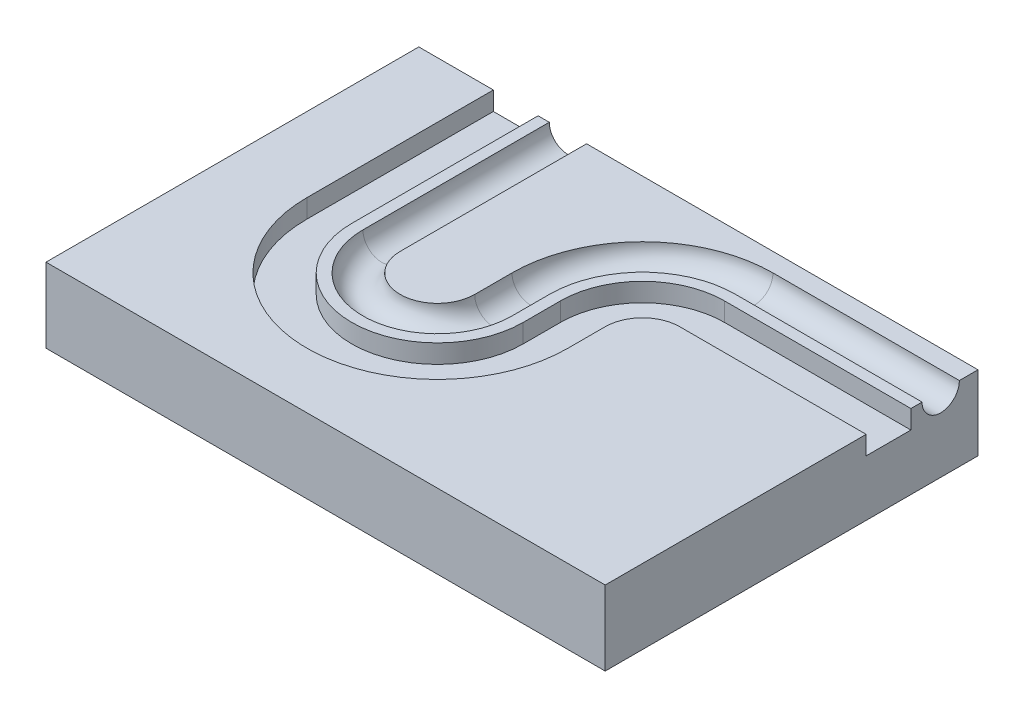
ISO-10303-21;
HEADER;
FILE_DESCRIPTION(('STEP AP214'),'2;1');
FILE_NAME('part.step','',(''),(''),'','','');
FILE_SCHEMA(('AUTOMOTIVE_DESIGN { 1 0 10303 214 1 1 1 1 }'));
ENDSEC;
DATA;
#1=APPLICATION_CONTEXT('core data for automotive mechanical design processes');
#2=APPLICATION_PROTOCOL_DEFINITION('international standard','automotive_design',2000,#1);
#3=PRODUCT_CONTEXT('',#1,'mechanical');
#4=PRODUCT('Part','Part','',(#3));
#5=PRODUCT_RELATED_PRODUCT_CATEGORY('part','',(#4));
#6=PRODUCT_DEFINITION_FORMATION('','',#4);
#7=PRODUCT_DEFINITION_CONTEXT('part definition',#1,'design');
#8=PRODUCT_DEFINITION('design','',#6,#7);
#9=PRODUCT_DEFINITION_SHAPE('','',#8);
#10=(LENGTH_UNIT() NAMED_UNIT(*) SI_UNIT(.MILLI.,.METRE.));
#11=(NAMED_UNIT(*) PLANE_ANGLE_UNIT() SI_UNIT($,.RADIAN.));
#12=(NAMED_UNIT(*) SI_UNIT($,.STERADIAN.) SOLID_ANGLE_UNIT());
#13=UNCERTAINTY_MEASURE_WITH_UNIT(LENGTH_MEASURE(1.E-05),#10,'distance_accuracy_value','');
#14=(GEOMETRIC_REPRESENTATION_CONTEXT(3) GLOBAL_UNCERTAINTY_ASSIGNED_CONTEXT((#13)) GLOBAL_UNIT_ASSIGNED_CONTEXT((#10,
#11,#12)) REPRESENTATION_CONTEXT('',''));
#15=CARTESIAN_POINT('',(0.,0.,0.));
#16=DIRECTION('',(0.,0.,1.));
#17=DIRECTION('',(1.,0.,0.));
#18=AXIS2_PLACEMENT_3D('',#15,#16,#17);
#19=CARTESIAN_POINT('',(0.,10.,-100.));
#20=DIRECTION('',(0.,0.,1.));
#21=DIRECTION('',(1.,0.,0.));
#22=AXIS2_PLACEMENT_3D('',#19,#20,#21);
#23=PLANE('',#22);
#24=CARTESIAN_POINT('',(40.,10.,-100.));
#25=DIRECTION('',(0.,0.,1.));
#26=DIRECTION('',(1.,0.,0.));
#27=AXIS2_PLACEMENT_3D('',#24,#25,#26);
#28=CIRCLE('',#27,5.);
#29=CARTESIAN_POINT('',(35.,10.,-100.));
#30=VERTEX_POINT('',#29);
#31=CARTESIAN_POINT('',(45.,10.,-100.));
#32=VERTEX_POINT('',#31);
#33=EDGE_CURVE('E189',#30,#32,#28,.T.);
#34=ORIENTED_EDGE('',*,*,#33,.T.);
#35=DIRECTION('',(-1.,0.,0.));
#36=VECTOR('',#35,1.);
#37=CARTESIAN_POINT('',(0.,10.,-100.));
#38=LINE('',#37,#36);
#39=CARTESIAN_POINT('',(150.,10.,-100.));
#40=VERTEX_POINT('',#39);
#41=EDGE_CURVE('E353',#40,#32,#38,.T.);
#42=ORIENTED_EDGE('',*,*,#41,.F.);
#43=DIRECTION('',(0.,-1.,0.));
#44=VECTOR('',#43,1.);
#45=CARTESIAN_POINT('',(150.,10.,-100.));
#46=LINE('',#45,#44);
#47=CARTESIAN_POINT('',(150.,-10.,-100.));
#48=VERTEX_POINT('',#47);
#49=EDGE_CURVE('E359',#40,#48,#46,.T.);
#50=ORIENTED_EDGE('',*,*,#49,.T.);
#51=DIRECTION('',(-1.,0.,0.));
#52=VECTOR('',#51,1.);
#53=CARTESIAN_POINT('',(0.,-10.,-100.));
#54=LINE('',#53,#52);
#55=CARTESIAN_POINT('',(0.,-10.,-100.));
#56=VERTEX_POINT('',#55);
#57=EDGE_CURVE('E340',#48,#56,#54,.T.);
#58=ORIENTED_EDGE('',*,*,#57,.T.);
#59=DIRECTION('',(0.,-1.,0.));
#60=VECTOR('',#59,1.);
#61=CARTESIAN_POINT('',(0.,10.,-100.));
#62=LINE('',#61,#60);
#63=CARTESIAN_POINT('',(0.,10.,-100.));
#64=VERTEX_POINT('',#63);
#65=EDGE_CURVE('E355',#64,#56,#62,.T.);
#66=ORIENTED_EDGE('',*,*,#65,.F.);
#67=CARTESIAN_POINT('',(20.,10.,-100.));
#68=VERTEX_POINT('',#67);
#69=EDGE_CURVE('E351',#68,#64,#38,.T.);
#70=ORIENTED_EDGE('',*,*,#69,.F.);
#71=DIRECTION('',(0.,-1.,0.));
#72=VECTOR('',#71,1.);
#73=CARTESIAN_POINT('',(20.,10.,-100.));
#74=LINE('',#73,#72);
#75=CARTESIAN_POINT('',(20.,5.,-100.));
#76=VERTEX_POINT('',#75);
#77=EDGE_CURVE('E312',#68,#76,#74,.T.);
#78=ORIENTED_EDGE('',*,*,#77,.T.);
#79=DIRECTION('',(1.,0.,0.));
#80=VECTOR('',#79,1.);
#81=CARTESIAN_POINT('',(20.,5.,-100.));
#82=LINE('',#81,#80);
#83=CARTESIAN_POINT('',(32.,5.,-100.));
#84=VERTEX_POINT('',#83);
#85=EDGE_CURVE('E315',#76,#84,#82,.T.);
#86=ORIENTED_EDGE('',*,*,#85,.T.);
#87=DIRECTION('',(0.,1.,0.));
#88=VECTOR('',#87,1.);
#89=CARTESIAN_POINT('',(32.,10.,-100.));
#90=LINE('',#89,#88);
#91=CARTESIAN_POINT('',(32.,10.,-100.));
#92=VERTEX_POINT('',#91);
#93=EDGE_CURVE('E318',#84,#92,#90,.T.);
#94=ORIENTED_EDGE('',*,*,#93,.T.);
#95=EDGE_CURVE('E356',#30,#92,#38,.T.);
#96=ORIENTED_EDGE('',*,*,#95,.F.);
#97=EDGE_LOOP('',(#34,#42,#50,#58,#66,#70,#78,#86,#94,#96));
#98=FACE_BOUND('',#97,.T.);
#99=ADVANCED_FACE('F33',(#98),#23,.F.);
#100=CARTESIAN_POINT('',(0.,10.,0.));
#101=DIRECTION('',(0.,1.,0.));
#102=DIRECTION('',(0.,0.,1.));
#103=AXIS2_PLACEMENT_3D('',#100,#101,#102);
#104=PLANE('',#103);
#105=CARTESIAN_POINT('',(55.,10.,-50.));
#106=DIRECTION('',(0.,1.,0.));
#107=DIRECTION('',(0.,0.,1.));
#108=AXIS2_PLACEMENT_3D('',#105,#106,#107);
#109=CIRCLE('',#108,20.);
#110=CARTESIAN_POINT('',(75.,10.,-50.));
#111=VERTEX_POINT('',#110);
#112=CARTESIAN_POINT('',(35.,10.,-50.));
#113=VERTEX_POINT('',#112);
#114=EDGE_CURVE('E41',#111,#113,#109,.F.);
#115=ORIENTED_EDGE('',*,*,#114,.T.);
#116=DIRECTION('',(0.,0.,-1.));
#117=VECTOR('',#116,1.);
#118=CARTESIAN_POINT('',(35.,10.,-50.));
#119=LINE('',#118,#117);
#120=EDGE_CURVE('E11',#113,#30,#119,.T.);
#121=ORIENTED_EDGE('',*,*,#120,.T.);
#122=ORIENTED_EDGE('',*,*,#95,.T.);
#123=DIRECTION('',(0.,0.,-1.));
#124=VECTOR('',#123,1.);
#125=CARTESIAN_POINT('',(32.,10.,-50.));
#126=LINE('',#125,#124);
#127=CARTESIAN_POINT('',(32.,10.,-50.));
#128=VERTEX_POINT('',#127);
#129=EDGE_CURVE('E327',#128,#92,#126,.T.);
#130=ORIENTED_EDGE('',*,*,#129,.F.);
#131=CARTESIAN_POINT('',(55.,10.,-50.));
#132=DIRECTION('',(0.,-1.,0.));
#133=DIRECTION('',(0.,0.,-1.));
#134=AXIS2_PLACEMENT_3D('',#131,#132,#133);
#135=CIRCLE('',#134,23.);
#136=CARTESIAN_POINT('',(78.,10.,-50.));
#137=VERTEX_POINT('',#136);
#138=EDGE_CURVE('E306',#137,#128,#135,.T.);
#139=ORIENTED_EDGE('',*,*,#138,.F.);
#140=DIRECTION('',(0.,0.,1.));
#141=VECTOR('',#140,1.);
#142=CARTESIAN_POINT('',(78.,10.,-60.));
#143=LINE('',#142,#141);
#144=CARTESIAN_POINT('',(78.,10.,-60.));
#145=VERTEX_POINT('',#144);
#146=EDGE_CURVE('E289',#145,#137,#143,.T.);
#147=ORIENTED_EDGE('',*,*,#146,.F.);
#148=CARTESIAN_POINT('',(100.,10.,-60.));
#149=DIRECTION('',(0.,1.,0.));
#150=DIRECTION('',(0.,0.,1.));
#151=AXIS2_PLACEMENT_3D('',#148,#149,#150);
#152=CIRCLE('',#151,22.);
#153=CARTESIAN_POINT('',(100.,10.,-82.));
#154=VERTEX_POINT('',#153);
#155=EDGE_CURVE('E272',#154,#145,#152,.T.);
#156=ORIENTED_EDGE('',*,*,#155,.F.);
#157=DIRECTION('',(1.,0.,0.));
#158=VECTOR('',#157,1.);
#159=CARTESIAN_POINT('',(100.,10.,-82.));
#160=LINE('',#159,#158);
#161=CARTESIAN_POINT('',(150.,10.,-82.));
#162=VERTEX_POINT('',#161);
#163=EDGE_CURVE('E257',#154,#162,#160,.T.);
#164=ORIENTED_EDGE('',*,*,#163,.T.);
#165=DIRECTION('',(0.,0.,-1.));
#166=VECTOR('',#165,1.);
#167=CARTESIAN_POINT('',(150.,10.,-100.));
#168=LINE('',#167,#166);
#169=CARTESIAN_POINT('',(150.,10.,-85.));
#170=VERTEX_POINT('',#169);
#171=EDGE_CURVE('E352',#162,#170,#168,.T.);
#172=ORIENTED_EDGE('',*,*,#171,.T.);
#173=DIRECTION('',(1.,0.,0.));
#174=VECTOR('',#173,1.);
#175=CARTESIAN_POINT('',(100.,10.,-85.));
#176=LINE('',#175,#174);
#177=CARTESIAN_POINT('',(100.,10.,-85.));
#178=VERTEX_POINT('',#177);
#179=EDGE_CURVE('E48',#178,#170,#176,.T.);
#180=ORIENTED_EDGE('',*,*,#179,.F.);
#181=CARTESIAN_POINT('',(100.,10.,-60.));
#182=DIRECTION('',(0.,-1.,0.));
#183=DIRECTION('',(0.,0.,-1.));
#184=AXIS2_PLACEMENT_3D('',#181,#182,#183);
#185=CIRCLE('',#184,25.);
#186=CARTESIAN_POINT('',(75.,10.,-60.));
#187=VERTEX_POINT('',#186);
#188=EDGE_CURVE('E197',#178,#187,#185,.F.);
#189=ORIENTED_EDGE('',*,*,#188,.T.);
#190=DIRECTION('',(0.,0.,1.));
#191=VECTOR('',#190,1.);
#192=CARTESIAN_POINT('',(75.,10.,-60.));
#193=LINE('',#192,#191);
#194=EDGE_CURVE('E217',#187,#111,#193,.T.);
#195=ORIENTED_EDGE('',*,*,#194,.T.);
#196=EDGE_LOOP('',(#115,#121,#122,#130,#139,#147,#156,#164,#172,#180,#189,#195));
#197=FACE_BOUND('',#196,.T.);
#198=ADVANCED_FACE('F221',(#197),#104,.T.);
#199=ORIENTED_EDGE('',*,*,#41,.T.);
#200=DIRECTION('',(0.,0.,-1.));
#201=VECTOR('',#200,1.);
#202=CARTESIAN_POINT('',(45.,10.,-50.));
#203=LINE('',#202,#201);
#204=CARTESIAN_POINT('',(45.,10.,-50.));
#205=VERTEX_POINT('',#204);
#206=EDGE_CURVE('E213',#32,#205,#203,.F.);
#207=ORIENTED_EDGE('',*,*,#206,.T.);
#208=CARTESIAN_POINT('',(55.,10.,-50.));
#209=DIRECTION('',(0.,-1.,0.));
#210=DIRECTION('',(0.,0.,-1.));
#211=AXIS2_PLACEMENT_3D('',#208,#209,#210);
#212=CIRCLE('',#211,9.99999999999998);
#213=CARTESIAN_POINT('',(65.,10.,-50.));
#214=VERTEX_POINT('',#213);
#215=EDGE_CURVE('E206',#205,#214,#212,.F.);
#216=ORIENTED_EDGE('',*,*,#215,.T.);
#217=DIRECTION('',(0.,0.,1.));
#218=VECTOR('',#217,1.);
#219=CARTESIAN_POINT('',(65.,10.,-60.));
#220=LINE('',#219,#218);
#221=CARTESIAN_POINT('',(65.,10.,-60.));
#222=VERTEX_POINT('',#221);
#223=EDGE_CURVE('E204',#214,#222,#220,.F.);
#224=ORIENTED_EDGE('',*,*,#223,.T.);
#225=CARTESIAN_POINT('',(100.,10.,-60.));
#226=DIRECTION('',(0.,1.,0.));
#227=DIRECTION('',(0.,0.,1.));
#228=AXIS2_PLACEMENT_3D('',#225,#226,#227);
#229=CIRCLE('',#228,35.);
#230=CARTESIAN_POINT('',(100.,10.,-95.));
#231=VERTEX_POINT('',#230);
#232=EDGE_CURVE('E194',#222,#231,#229,.F.);
#233=ORIENTED_EDGE('',*,*,#232,.T.);
#234=DIRECTION('',(1.,0.,0.));
#235=VECTOR('',#234,1.);
#236=CARTESIAN_POINT('',(100.,10.,-95.));
#237=LINE('',#236,#235);
#238=CARTESIAN_POINT('',(150.,10.,-95.));
#239=VERTEX_POINT('',#238);
#240=EDGE_CURVE('E181',#239,#231,#237,.F.);
#241=ORIENTED_EDGE('',*,*,#240,.F.);
#242=EDGE_CURVE('E347',#239,#40,#168,.T.);
#243=ORIENTED_EDGE('',*,*,#242,.T.);
#244=EDGE_LOOP('',(#199,#207,#216,#224,#233,#241,#243));
#245=FACE_BOUND('',#244,.T.);
#246=ADVANCED_FACE('F202',(#245),#104,.T.);
#247=CARTESIAN_POINT('',(55.,10.,-50.));
#248=DIRECTION('',(0.,-1.,0.));
#249=DIRECTION('',(0.,0.,-1.));
#250=AXIS2_PLACEMENT_3D('',#247,#248,#249);
#251=CIRCLE('',#250,35.);
#252=CARTESIAN_POINT('',(90.,10.,-50.));
#253=VERTEX_POINT('',#252);
#254=CARTESIAN_POINT('',(20.,10.,-50.));
#255=VERTEX_POINT('',#254);
#256=EDGE_CURVE('E309',#253,#255,#251,.T.);
#257=ORIENTED_EDGE('',*,*,#256,.T.);
#258=DIRECTION('',(0.,0.,-1.));
#259=VECTOR('',#258,1.);
#260=CARTESIAN_POINT('',(20.,10.,-50.));
#261=LINE('',#260,#259);
#262=EDGE_CURVE('E330',#255,#68,#261,.T.);
#263=ORIENTED_EDGE('',*,*,#262,.T.);
#264=ORIENTED_EDGE('',*,*,#69,.T.);
#265=DIRECTION('',(0.,0.,1.));
#266=VECTOR('',#265,1.);
#267=CARTESIAN_POINT('',(0.,10.,-100.));
#268=LINE('',#267,#266);
#269=CARTESIAN_POINT('',(0.,10.,0.));
#270=VERTEX_POINT('',#269);
#271=EDGE_CURVE('E342',#64,#270,#268,.T.);
#272=ORIENTED_EDGE('',*,*,#271,.T.);
#273=DIRECTION('',(1.,0.,0.));
#274=VECTOR('',#273,1.);
#275=CARTESIAN_POINT('',(0.,10.,0.));
#276=LINE('',#275,#274);
#277=CARTESIAN_POINT('',(150.,10.,0.));
#278=VERTEX_POINT('',#277);
#279=EDGE_CURVE('E345',#270,#278,#276,.T.);
#280=ORIENTED_EDGE('',*,*,#279,.T.);
#281=CARTESIAN_POINT('',(150.,10.,-70.));
#282=VERTEX_POINT('',#281);
#283=EDGE_CURVE('E348',#278,#282,#168,.T.);
#284=ORIENTED_EDGE('',*,*,#283,.T.);
#285=DIRECTION('',(1.,0.,0.));
#286=VECTOR('',#285,1.);
#287=CARTESIAN_POINT('',(100.,10.,-70.));
#288=LINE('',#287,#286);
#289=CARTESIAN_POINT('',(100.,10.,-70.));
#290=VERTEX_POINT('',#289);
#291=EDGE_CURVE('E254',#290,#282,#288,.T.);
#292=ORIENTED_EDGE('',*,*,#291,.F.);
#293=CARTESIAN_POINT('',(100.,10.,-60.));
#294=DIRECTION('',(0.,1.,0.));
#295=DIRECTION('',(0.,0.,1.));
#296=AXIS2_PLACEMENT_3D('',#293,#294,#295);
#297=CIRCLE('',#296,10.);
#298=CARTESIAN_POINT('',(90.,10.,-60.));
#299=VERTEX_POINT('',#298);
#300=EDGE_CURVE('E275',#290,#299,#297,.T.);
#301=ORIENTED_EDGE('',*,*,#300,.T.);
#302=DIRECTION('',(0.,0.,1.));
#303=VECTOR('',#302,1.);
#304=CARTESIAN_POINT('',(90.,10.,-60.));
#305=LINE('',#304,#303);
#306=EDGE_CURVE('E292',#299,#253,#305,.T.);
#307=ORIENTED_EDGE('',*,*,#306,.T.);
#308=EDGE_LOOP('',(#257,#263,#264,#272,#280,#284,#292,#301,#307));
#309=FACE_BOUND('',#308,.T.);
#310=ADVANCED_FACE('F397',(#309),#104,.T.);
#311=CARTESIAN_POINT('',(0.,10.,-100.));
#312=DIRECTION('',(1.,0.,0.));
#313=DIRECTION('',(0.,0.,-1.));
#314=AXIS2_PLACEMENT_3D('',#311,#312,#313);
#315=PLANE('',#314);
#316=DIRECTION('',(0.,0.,1.));
#317=VECTOR('',#316,1.);
#318=CARTESIAN_POINT('',(0.,-10.,-100.));
#319=LINE('',#318,#317);
#320=CARTESIAN_POINT('',(0.,-10.,0.));
#321=VERTEX_POINT('',#320);
#322=EDGE_CURVE('E333',#56,#321,#319,.T.);
#323=ORIENTED_EDGE('',*,*,#322,.T.);
#324=DIRECTION('',(0.,-1.,0.));
#325=VECTOR('',#324,1.);
#326=CARTESIAN_POINT('',(0.,10.,0.));
#327=LINE('',#326,#325);
#328=EDGE_CURVE('E208',#270,#321,#327,.T.);
#329=ORIENTED_EDGE('',*,*,#328,.F.);
#330=ORIENTED_EDGE('',*,*,#271,.F.);
#331=ORIENTED_EDGE('',*,*,#65,.T.);
#332=EDGE_LOOP('',(#323,#329,#330,#331));
#333=FACE_BOUND('',#332,.T.);
#334=ADVANCED_FACE('F35',(#333),#315,.F.);
#335=CARTESIAN_POINT('',(0.,10.,0.));
#336=DIRECTION('',(0.,0.,-1.));
#337=DIRECTION('',(-1.,0.,0.));
#338=AXIS2_PLACEMENT_3D('',#335,#336,#337);
#339=PLANE('',#338);
#340=DIRECTION('',(1.,0.,0.));
#341=VECTOR('',#340,1.);
#342=CARTESIAN_POINT('',(0.,-10.,0.));
#343=LINE('',#342,#341);
#344=CARTESIAN_POINT('',(150.,-10.,0.));
#345=VERTEX_POINT('',#344);
#346=EDGE_CURVE('E336',#321,#345,#343,.T.);
#347=ORIENTED_EDGE('',*,*,#346,.T.);
#348=DIRECTION('',(0.,-1.,0.));
#349=VECTOR('',#348,1.);
#350=CARTESIAN_POINT('',(150.,10.,0.));
#351=LINE('',#350,#349);
#352=EDGE_CURVE('E362',#278,#345,#351,.T.);
#353=ORIENTED_EDGE('',*,*,#352,.F.);
#354=ORIENTED_EDGE('',*,*,#279,.F.);
#355=ORIENTED_EDGE('',*,*,#328,.T.);
#356=EDGE_LOOP('',(#347,#353,#354,#355));
#357=FACE_BOUND('',#356,.T.);
#358=ADVANCED_FACE('F367',(#357),#339,.F.);
#359=CARTESIAN_POINT('',(150.,10.,-100.));
#360=DIRECTION('',(-1.,0.,0.));
#361=DIRECTION('',(0.,0.,1.));
#362=AXIS2_PLACEMENT_3D('',#359,#360,#361);
#363=PLANE('',#362);
#364=ORIENTED_EDGE('',*,*,#242,.F.);
#365=CARTESIAN_POINT('',(150.,10.,-90.));
#366=DIRECTION('',(-1.,0.,0.));
#367=DIRECTION('',(0.,0.,1.));
#368=AXIS2_PLACEMENT_3D('',#365,#366,#367);
#369=CIRCLE('',#368,5.);
#370=EDGE_CURVE('E185',#239,#170,#369,.T.);
#371=ORIENTED_EDGE('',*,*,#370,.T.);
#372=ORIENTED_EDGE('',*,*,#171,.F.);
#373=DIRECTION('',(0.,1.,0.));
#374=VECTOR('',#373,1.);
#375=CARTESIAN_POINT('',(150.,10.,-82.));
#376=LINE('',#375,#374);
#377=CARTESIAN_POINT('',(150.,5.,-82.));
#378=VERTEX_POINT('',#377);
#379=EDGE_CURVE('E56',#378,#162,#376,.T.);
#380=ORIENTED_EDGE('',*,*,#379,.F.);
#381=DIRECTION('',(0.,0.,-1.));
#382=VECTOR('',#381,1.);
#383=CARTESIAN_POINT('',(150.,5.,-70.));
#384=LINE('',#383,#382);
#385=CARTESIAN_POINT('',(150.,5.,-70.));
#386=VERTEX_POINT('',#385);
#387=EDGE_CURVE('E243',#386,#378,#384,.T.);
#388=ORIENTED_EDGE('',*,*,#387,.F.);
#389=DIRECTION('',(0.,-1.,0.));
#390=VECTOR('',#389,1.);
#391=CARTESIAN_POINT('',(150.,10.,-70.));
#392=LINE('',#391,#390);
#393=EDGE_CURVE('E240',#282,#386,#392,.T.);
#394=ORIENTED_EDGE('',*,*,#393,.F.);
#395=ORIENTED_EDGE('',*,*,#283,.F.);
#396=ORIENTED_EDGE('',*,*,#352,.T.);
#397=DIRECTION('',(0.,0.,-1.));
#398=VECTOR('',#397,1.);
#399=CARTESIAN_POINT('',(150.,-10.,-100.));
#400=LINE('',#399,#398);
#401=EDGE_CURVE('E338',#345,#48,#400,.T.);
#402=ORIENTED_EDGE('',*,*,#401,.T.);
#403=ORIENTED_EDGE('',*,*,#49,.F.);
#404=EDGE_LOOP('',(#364,#371,#372,#380,#388,#394,#395,#396,#402,#403));
#405=FACE_BOUND('',#404,.T.);
#406=ADVANCED_FACE('F379',(#405),#363,.F.);
#407=CARTESIAN_POINT('',(0.,-10.,0.));
#408=DIRECTION('',(0.,1.,0.));
#409=DIRECTION('',(0.,0.,1.));
#410=AXIS2_PLACEMENT_3D('',#407,#408,#409);
#411=PLANE('',#410);
#412=ORIENTED_EDGE('',*,*,#322,.F.);
#413=ORIENTED_EDGE('',*,*,#57,.F.);
#414=ORIENTED_EDGE('',*,*,#401,.F.);
#415=ORIENTED_EDGE('',*,*,#346,.F.);
#416=EDGE_LOOP('',(#412,#413,#414,#415));
#417=FACE_BOUND('',#416,.T.);
#418=ADVANCED_FACE('F375',(#417),#411,.F.);
#419=CARTESIAN_POINT('',(32.,10.,-50.));
#420=DIRECTION('',(-1.,0.,0.));
#421=DIRECTION('',(0.,0.,1.));
#422=AXIS2_PLACEMENT_3D('',#419,#420,#421);
#423=PLANE('',#422);
#424=DIRECTION('',(0.,1.,0.));
#425=VECTOR('',#424,1.);
#426=CARTESIAN_POINT('',(32.,10.,-50.));
#427=LINE('',#426,#425);
#428=CARTESIAN_POINT('',(32.,5.,-50.));
#429=VERTEX_POINT('',#428);
#430=EDGE_CURVE('E298',#429,#128,#427,.T.);
#431=ORIENTED_EDGE('',*,*,#430,.T.);
#432=ORIENTED_EDGE('',*,*,#129,.T.);
#433=ORIENTED_EDGE('',*,*,#93,.F.);
#434=DIRECTION('',(0.,0.,-1.));
#435=VECTOR('',#434,1.);
#436=CARTESIAN_POINT('',(32.,5.,-50.));
#437=LINE('',#436,#435);
#438=EDGE_CURVE('E324',#429,#84,#437,.T.);
#439=ORIENTED_EDGE('',*,*,#438,.F.);
#440=EDGE_LOOP('',(#431,#432,#433,#439));
#441=FACE_BOUND('',#440,.T.);
#442=ADVANCED_FACE('F402',(#441),#423,.T.);
#443=CARTESIAN_POINT('',(20.,10.,-50.));
#444=DIRECTION('',(1.,0.,0.));
#445=DIRECTION('',(0.,0.,-1.));
#446=AXIS2_PLACEMENT_3D('',#443,#444,#445);
#447=PLANE('',#446);
#448=DIRECTION('',(0.,-1.,0.));
#449=VECTOR('',#448,1.);
#450=CARTESIAN_POINT('',(20.,10.,-50.));
#451=LINE('',#450,#449);
#452=CARTESIAN_POINT('',(20.,5.,-50.));
#453=VERTEX_POINT('',#452);
#454=EDGE_CURVE('E295',#255,#453,#451,.T.);
#455=ORIENTED_EDGE('',*,*,#454,.T.);
#456=DIRECTION('',(0.,0.,-1.));
#457=VECTOR('',#456,1.);
#458=CARTESIAN_POINT('',(20.,5.,-50.));
#459=LINE('',#458,#457);
#460=EDGE_CURVE('E321',#453,#76,#459,.T.);
#461=ORIENTED_EDGE('',*,*,#460,.T.);
#462=ORIENTED_EDGE('',*,*,#77,.F.);
#463=ORIENTED_EDGE('',*,*,#262,.F.);
#464=EDGE_LOOP('',(#455,#461,#462,#463));
#465=FACE_BOUND('',#464,.T.);
#466=ADVANCED_FACE('F405',(#465),#447,.T.);
#467=CARTESIAN_POINT('',(55.,10.,-50.));
#468=DIRECTION('',(0.,-1.,0.));
#469=DIRECTION('',(0.,0.,-1.));
#470=AXIS2_PLACEMENT_3D('',#467,#468,#469);
#471=CYLINDRICAL_SURFACE('',#470,23.);
#472=DIRECTION('',(0.,1.,0.));
#473=VECTOR('',#472,1.);
#474=CARTESIAN_POINT('',(78.,10.,-50.));
#475=LINE('',#474,#473);
#476=CARTESIAN_POINT('',(78.,5.,-50.));
#477=VERTEX_POINT('',#476);
#478=EDGE_CURVE('E281',#477,#137,#475,.T.);
#479=ORIENTED_EDGE('',*,*,#478,.T.);
#480=ORIENTED_EDGE('',*,*,#138,.T.);
#481=ORIENTED_EDGE('',*,*,#430,.F.);
#482=CARTESIAN_POINT('',(55.,5.,-50.));
#483=DIRECTION('',(0.,-1.,0.));
#484=DIRECTION('',(0.,0.,-1.));
#485=AXIS2_PLACEMENT_3D('',#482,#483,#484);
#486=CIRCLE('',#485,23.);
#487=EDGE_CURVE('E303',#477,#429,#486,.T.);
#488=ORIENTED_EDGE('',*,*,#487,.F.);
#489=EDGE_LOOP('',(#479,#480,#481,#488));
#490=FACE_BOUND('',#489,.T.);
#491=ADVANCED_FACE('F495',(#490),#471,.T.);
#492=CARTESIAN_POINT('',(55.,10.,-50.));
#493=DIRECTION('',(0.,-1.,0.));
#494=DIRECTION('',(0.,0.,-1.));
#495=AXIS2_PLACEMENT_3D('',#492,#493,#494);
#496=CYLINDRICAL_SURFACE('',#495,35.);
#497=DIRECTION('',(0.,-1.,0.));
#498=VECTOR('',#497,1.);
#499=CARTESIAN_POINT('',(90.,10.,-50.));
#500=LINE('',#499,#498);
#501=CARTESIAN_POINT('',(90.,5.,-50.));
#502=VERTEX_POINT('',#501);
#503=EDGE_CURVE('E278',#253,#502,#500,.T.);
#504=ORIENTED_EDGE('',*,*,#503,.T.);
#505=CARTESIAN_POINT('',(55.,5.,-50.));
#506=DIRECTION('',(0.,-1.,0.));
#507=DIRECTION('',(0.,0.,-1.));
#508=AXIS2_PLACEMENT_3D('',#505,#506,#507);
#509=CIRCLE('',#508,35.);
#510=EDGE_CURVE('E300',#502,#453,#509,.T.);
#511=ORIENTED_EDGE('',*,*,#510,.T.);
#512=ORIENTED_EDGE('',*,*,#454,.F.);
#513=ORIENTED_EDGE('',*,*,#256,.F.);
#514=EDGE_LOOP('',(#504,#511,#512,#513));
#515=FACE_BOUND('',#514,.T.);
#516=ADVANCED_FACE('F408',(#515),#496,.F.);
#517=CARTESIAN_POINT('',(78.,10.,-60.));
#518=DIRECTION('',(1.,0.,0.));
#519=DIRECTION('',(0.,0.,-1.));
#520=AXIS2_PLACEMENT_3D('',#517,#518,#519);
#521=PLANE('',#520);
#522=DIRECTION('',(0.,1.,0.));
#523=VECTOR('',#522,1.);
#524=CARTESIAN_POINT('',(78.,10.,-60.));
#525=LINE('',#524,#523);
#526=CARTESIAN_POINT('',(78.,5.,-60.));
#527=VERTEX_POINT('',#526);
#528=EDGE_CURVE('E264',#527,#145,#525,.T.);
#529=ORIENTED_EDGE('',*,*,#528,.T.);
#530=ORIENTED_EDGE('',*,*,#146,.T.);
#531=ORIENTED_EDGE('',*,*,#478,.F.);
#532=DIRECTION('',(0.,0.,1.));
#533=VECTOR('',#532,1.);
#534=CARTESIAN_POINT('',(78.,5.,-60.));
#535=LINE('',#534,#533);
#536=EDGE_CURVE('E286',#527,#477,#535,.T.);
#537=ORIENTED_EDGE('',*,*,#536,.F.);
#538=EDGE_LOOP('',(#529,#530,#531,#537));
#539=FACE_BOUND('',#538,.T.);
#540=ADVANCED_FACE('F513',(#539),#521,.T.);
#541=CARTESIAN_POINT('',(90.,10.,-60.));
#542=DIRECTION('',(-1.,0.,0.));
#543=DIRECTION('',(0.,0.,1.));
#544=AXIS2_PLACEMENT_3D('',#541,#542,#543);
#545=PLANE('',#544);
#546=DIRECTION('',(0.,-1.,0.));
#547=VECTOR('',#546,1.);
#548=CARTESIAN_POINT('',(90.,10.,-60.));
#549=LINE('',#548,#547);
#550=CARTESIAN_POINT('',(90.,5.,-60.));
#551=VERTEX_POINT('',#550);
#552=EDGE_CURVE('E256',#299,#551,#549,.T.);
#553=ORIENTED_EDGE('',*,*,#552,.T.);
#554=DIRECTION('',(0.,0.,1.));
#555=VECTOR('',#554,1.);
#556=CARTESIAN_POINT('',(90.,5.,-60.));
#557=LINE('',#556,#555);
#558=EDGE_CURVE('E283',#551,#502,#557,.T.);
#559=ORIENTED_EDGE('',*,*,#558,.T.);
#560=ORIENTED_EDGE('',*,*,#503,.F.);
#561=ORIENTED_EDGE('',*,*,#306,.F.);
#562=EDGE_LOOP('',(#553,#559,#560,#561));
#563=FACE_BOUND('',#562,.T.);
#564=ADVANCED_FACE('F412',(#563),#545,.T.);
#565=CARTESIAN_POINT('',(100.,10.,-60.));
#566=DIRECTION('',(0.,1.,0.));
#567=DIRECTION('',(0.,0.,1.));
#568=AXIS2_PLACEMENT_3D('',#565,#566,#567);
#569=CYLINDRICAL_SURFACE('',#568,22.);
#570=DIRECTION('',(0.,1.,0.));
#571=VECTOR('',#570,1.);
#572=CARTESIAN_POINT('',(100.,10.,-82.));
#573=LINE('',#572,#571);
#574=CARTESIAN_POINT('',(100.,5.,-82.));
#575=VERTEX_POINT('',#574);
#576=EDGE_CURVE('E250',#575,#154,#573,.T.);
#577=ORIENTED_EDGE('',*,*,#576,.T.);
#578=ORIENTED_EDGE('',*,*,#155,.T.);
#579=ORIENTED_EDGE('',*,*,#528,.F.);
#580=CARTESIAN_POINT('',(100.,5.,-60.));
#581=DIRECTION('',(0.,1.,0.));
#582=DIRECTION('',(0.,0.,1.));
#583=AXIS2_PLACEMENT_3D('',#580,#581,#582);
#584=CIRCLE('',#583,22.);
#585=EDGE_CURVE('E269',#575,#527,#584,.T.);
#586=ORIENTED_EDGE('',*,*,#585,.F.);
#587=EDGE_LOOP('',(#577,#578,#579,#586));
#588=FACE_BOUND('',#587,.T.);
#589=ADVANCED_FACE('F416',(#588),#569,.F.);
#590=CARTESIAN_POINT('',(100.,10.,-60.));
#591=DIRECTION('',(0.,1.,0.));
#592=DIRECTION('',(0.,0.,1.));
#593=AXIS2_PLACEMENT_3D('',#590,#591,#592);
#594=CYLINDRICAL_SURFACE('',#593,10.);
#595=DIRECTION('',(0.,-1.,0.));
#596=VECTOR('',#595,1.);
#597=CARTESIAN_POINT('',(100.,10.,-70.));
#598=LINE('',#597,#596);
#599=CARTESIAN_POINT('',(100.,5.,-70.));
#600=VERTEX_POINT('',#599);
#601=EDGE_CURVE('E247',#290,#600,#598,.T.);
#602=ORIENTED_EDGE('',*,*,#601,.T.);
#603=CARTESIAN_POINT('',(100.,5.,-60.));
#604=DIRECTION('',(0.,1.,0.));
#605=DIRECTION('',(0.,0.,1.));
#606=AXIS2_PLACEMENT_3D('',#603,#604,#605);
#607=CIRCLE('',#606,10.);
#608=EDGE_CURVE('E266',#600,#551,#607,.T.);
#609=ORIENTED_EDGE('',*,*,#608,.T.);
#610=ORIENTED_EDGE('',*,*,#552,.F.);
#611=ORIENTED_EDGE('',*,*,#300,.F.);
#612=EDGE_LOOP('',(#602,#609,#610,#611));
#613=FACE_BOUND('',#612,.T.);
#614=ADVANCED_FACE('F414',(#613),#594,.T.);
#615=CARTESIAN_POINT('',(100.,10.,-70.));
#616=DIRECTION('',(0.,0.,1.));
#617=DIRECTION('',(1.,0.,0.));
#618=AXIS2_PLACEMENT_3D('',#615,#616,#617);
#619=PLANE('',#618);
#620=ORIENTED_EDGE('',*,*,#393,.T.);
#621=DIRECTION('',(1.,0.,0.));
#622=VECTOR('',#621,1.);
#623=CARTESIAN_POINT('',(100.,5.,-70.));
#624=LINE('',#623,#622);
#625=EDGE_CURVE('E253',#600,#386,#624,.T.);
#626=ORIENTED_EDGE('',*,*,#625,.F.);
#627=ORIENTED_EDGE('',*,*,#601,.F.);
#628=ORIENTED_EDGE('',*,*,#291,.T.);
#629=EDGE_LOOP('',(#620,#626,#627,#628));
#630=FACE_BOUND('',#629,.T.);
#631=ADVANCED_FACE('F394',(#630),#619,.F.);
#632=CARTESIAN_POINT('',(100.,10.,-82.));
#633=DIRECTION('',(0.,0.,-1.));
#634=DIRECTION('',(-1.,0.,0.));
#635=AXIS2_PLACEMENT_3D('',#632,#633,#634);
#636=PLANE('',#635);
#637=ORIENTED_EDGE('',*,*,#379,.T.);
#638=ORIENTED_EDGE('',*,*,#163,.F.);
#639=ORIENTED_EDGE('',*,*,#576,.F.);
#640=DIRECTION('',(1.,0.,0.));
#641=VECTOR('',#640,1.);
#642=CARTESIAN_POINT('',(100.,5.,-82.));
#643=LINE('',#642,#641);
#644=EDGE_CURVE('E259',#575,#378,#643,.T.);
#645=ORIENTED_EDGE('',*,*,#644,.T.);
#646=EDGE_LOOP('',(#637,#638,#639,#645));
#647=FACE_BOUND('',#646,.T.);
#648=ADVANCED_FACE('F422',(#647),#636,.F.);
#649=CARTESIAN_POINT('',(100.,5.,-70.));
#650=DIRECTION('',(0.,-1.,0.));
#651=DIRECTION('',(0.,0.,-1.));
#652=AXIS2_PLACEMENT_3D('',#649,#650,#651);
#653=PLANE('',#652);
#654=ORIENTED_EDGE('',*,*,#387,.T.);
#655=ORIENTED_EDGE('',*,*,#644,.F.);
#656=ORIENTED_EDGE('',*,*,#585,.T.);
#657=ORIENTED_EDGE('',*,*,#536,.T.);
#658=ORIENTED_EDGE('',*,*,#487,.T.);
#659=ORIENTED_EDGE('',*,*,#438,.T.);
#660=ORIENTED_EDGE('',*,*,#85,.F.);
#661=ORIENTED_EDGE('',*,*,#460,.F.);
#662=ORIENTED_EDGE('',*,*,#510,.F.);
#663=ORIENTED_EDGE('',*,*,#558,.F.);
#664=ORIENTED_EDGE('',*,*,#608,.F.);
#665=ORIENTED_EDGE('',*,*,#625,.T.);
#666=EDGE_LOOP('',(#654,#655,#656,#657,#658,#659,#660,#661,#662,#663,#664,#665));
#667=FACE_BOUND('',#666,.T.);
#668=ADVANCED_FACE('F390',(#667),#653,.F.);
#669=CARTESIAN_POINT('',(40.,10.,-50.));
#670=DIRECTION('',(0.,0.,-1.));
#671=DIRECTION('',(-1.,0.,0.));
#672=AXIS2_PLACEMENT_3D('',#669,#670,#671);
#673=CYLINDRICAL_SURFACE('',#672,5.);
#674=ORIENTED_EDGE('',*,*,#33,.F.);
#675=ORIENTED_EDGE('',*,*,#120,.F.);
#676=CARTESIAN_POINT('',(40.,10.,-50.));
#677=DIRECTION('',(0.,0.,1.));
#678=DIRECTION('',(1.,0.,0.));
#679=AXIS2_PLACEMENT_3D('',#676,#677,#678);
#680=CIRCLE('',#679,5.);
#681=EDGE_CURVE('E230',#113,#205,#680,.T.);
#682=ORIENTED_EDGE('',*,*,#681,.T.);
#683=ORIENTED_EDGE('',*,*,#206,.F.);
#684=EDGE_LOOP('',(#674,#675,#682,#683));
#685=FACE_BOUND('',#684,.T.);
#686=ADVANCED_FACE('F564',(#685),#673,.F.);
#687=CARTESIAN_POINT('',(55.,10.,-50.));
#688=DIRECTION('',(0.,-1.,0.));
#689=DIRECTION('',(0.,0.,-1.));
#690=AXIS2_PLACEMENT_3D('',#687,#688,#689);
#691=TOROIDAL_SURFACE('',#690,15.,5.);
#692=CARTESIAN_POINT('',(70.,10.,-50.));
#693=DIRECTION('',(0.,0.,-1.));
#694=DIRECTION('',(-1.,0.,0.));
#695=AXIS2_PLACEMENT_3D('',#692,#693,#694);
#696=CIRCLE('',#695,5.);
#697=EDGE_CURVE('E228',#111,#214,#696,.T.);
#698=ORIENTED_EDGE('',*,*,#697,.T.);
#699=ORIENTED_EDGE('',*,*,#215,.F.);
#700=ORIENTED_EDGE('',*,*,#681,.F.);
#701=ORIENTED_EDGE('',*,*,#114,.F.);
#702=EDGE_LOOP('',(#698,#699,#700,#701));
#703=FACE_BOUND('',#702,.T.);
#704=ADVANCED_FACE('F227',(#703),#691,.F.);
#705=CARTESIAN_POINT('',(70.,10.,-60.));
#706=DIRECTION('',(0.,0.,1.));
#707=DIRECTION('',(1.,0.,0.));
#708=AXIS2_PLACEMENT_3D('',#705,#706,#707);
#709=CYLINDRICAL_SURFACE('',#708,5.);
#710=ORIENTED_EDGE('',*,*,#697,.F.);
#711=ORIENTED_EDGE('',*,*,#194,.F.);
#712=CARTESIAN_POINT('',(70.,10.,-60.));
#713=DIRECTION('',(0.,0.,-1.));
#714=DIRECTION('',(-1.,0.,0.));
#715=AXIS2_PLACEMENT_3D('',#712,#713,#714);
#716=CIRCLE('',#715,5.);
#717=EDGE_CURVE('E198',#187,#222,#716,.T.);
#718=ORIENTED_EDGE('',*,*,#717,.T.);
#719=ORIENTED_EDGE('',*,*,#223,.F.);
#720=EDGE_LOOP('',(#710,#711,#718,#719));
#721=FACE_BOUND('',#720,.T.);
#722=ADVANCED_FACE('F232',(#721),#709,.F.);
#723=CARTESIAN_POINT('',(100.,10.,-60.));
#724=DIRECTION('',(0.,1.,0.));
#725=DIRECTION('',(0.,0.,1.));
#726=AXIS2_PLACEMENT_3D('',#723,#724,#725);
#727=TOROIDAL_SURFACE('',#726,30.,5.);
#728=ORIENTED_EDGE('',*,*,#717,.F.);
#729=ORIENTED_EDGE('',*,*,#188,.F.);
#730=CARTESIAN_POINT('',(100.,10.,-90.));
#731=DIRECTION('',(1.,0.,0.));
#732=DIRECTION('',(0.,0.,-1.));
#733=AXIS2_PLACEMENT_3D('',#730,#731,#732);
#734=CIRCLE('',#733,5.);
#735=EDGE_CURVE('E184',#178,#231,#734,.T.);
#736=ORIENTED_EDGE('',*,*,#735,.T.);
#737=ORIENTED_EDGE('',*,*,#232,.F.);
#738=EDGE_LOOP('',(#728,#729,#736,#737));
#739=FACE_BOUND('',#738,.T.);
#740=ADVANCED_FACE('F193',(#739),#727,.F.);
#741=CARTESIAN_POINT('',(100.,10.,-90.));
#742=DIRECTION('',(1.,0.,0.));
#743=DIRECTION('',(0.,0.,-1.));
#744=AXIS2_PLACEMENT_3D('',#741,#742,#743);
#745=CYLINDRICAL_SURFACE('',#744,5.);
#746=ORIENTED_EDGE('',*,*,#179,.T.);
#747=ORIENTED_EDGE('',*,*,#370,.F.);
#748=ORIENTED_EDGE('',*,*,#240,.T.);
#749=ORIENTED_EDGE('',*,*,#735,.F.);
#750=EDGE_LOOP('',(#746,#747,#748,#749));
#751=FACE_BOUND('',#750,.T.);
#752=ADVANCED_FACE('F183',(#751),#745,.F.);
#753=CLOSED_SHELL('',(#99,#198,#246,#310,#334,#358,#406,#418,#442,#466,#491,#516,#540,#564,#589,
#614,#631,#648,#668,#686,#704,#722,#740,#752));
#754=MANIFOLD_SOLID_BREP('B2',#753);
#755=ADVANCED_BREP_SHAPE_REPRESENTATION('',(#18,#754),#14);
#756=SHAPE_DEFINITION_REPRESENTATION(#9,#755);
ENDSEC;
END-ISO-10303-21;
